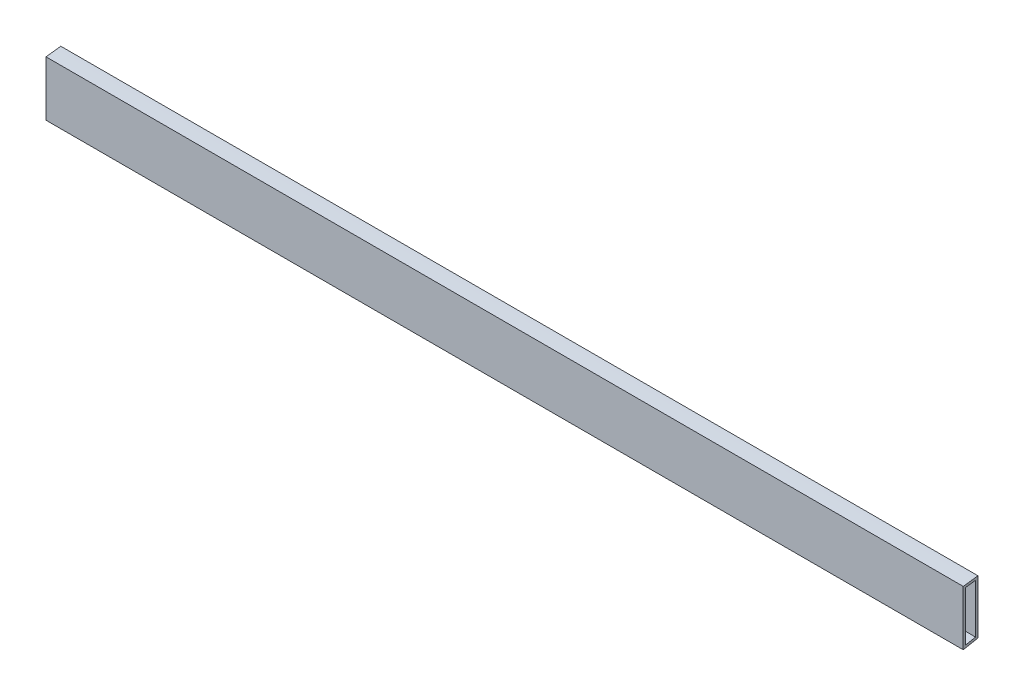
from build123d import *

# Parameters (mm, degrees)
BOSS_EXTRUDE1_DEPTH = 295.275


with BuildPart() as part:
    # Sketch1 → Boss-Extrude1 (new body)
    with BuildSketch(Plane(origin=(0, 0, 0), x_dir=(0, 0, -1), z_dir=(1, 0, 0))):
        with BuildLine():
            Line((31.75, 18.908657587), (31.75, 1.227331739))
            add(Edge.make_bspline(
                [(31.75, 1.227331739), (32.773582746, 1.422082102), (34.360873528, 1.723481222), (35.94861836, 2.022518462), (36.5125, 2.128273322)],
                knots=[0.620226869, 0.620226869, 0.620226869, 0.620226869, 0.6304436, 0.636069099, 0.636069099, 0.636069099, 0.636069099], degree=3))
            Line((36.5125, 2.128273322), (36.5125, 19.482508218))
            add(Edge.make_bspline(
                [(36.5125, 19.482508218), (35.315332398, 19.376698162), (33.725757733, 19.197098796), (32.142829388, 18.96857746), (31.75, 18.908657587)],
                knots=[0.367832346, 0.367832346, 0.367832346, 0.367832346, 0.379615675, 0.383511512, 0.383511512, 0.383511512, 0.383511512], degree=3))
        make_face()
        with BuildLine():
            Line((32.54375, 18.223643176), (32.54375, 2.186214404))
            add(Edge.make_bspline(
                [(32.54375, 2.186214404), (33.60192669, 2.387238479), (34.660215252, 2.587677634), (35.71875, 2.786807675)],
                knots=[0.623360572, 0.623360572, 0.623360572, 0.623360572, 0.633917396, 0.633917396, 0.633917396, 0.633917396], degree=3))
            Line((35.71875, 2.786807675), (35.71875, 18.610370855))
            add(Edge.make_bspline(
                [(35.71875, 18.610370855), (34.657913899, 18.504004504), (33.599137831, 18.374784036), (32.54375, 18.223643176)],
                knots=[0.37069791, 0.37069791, 0.37069791, 0.37069791, 0.381261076, 0.381261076, 0.381261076, 0.381261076], degree=3))
        make_face(mode=Mode.SUBTRACT)
    extrude(amount=BOSS_EXTRUDE1_DEPTH)


solid = part.part
